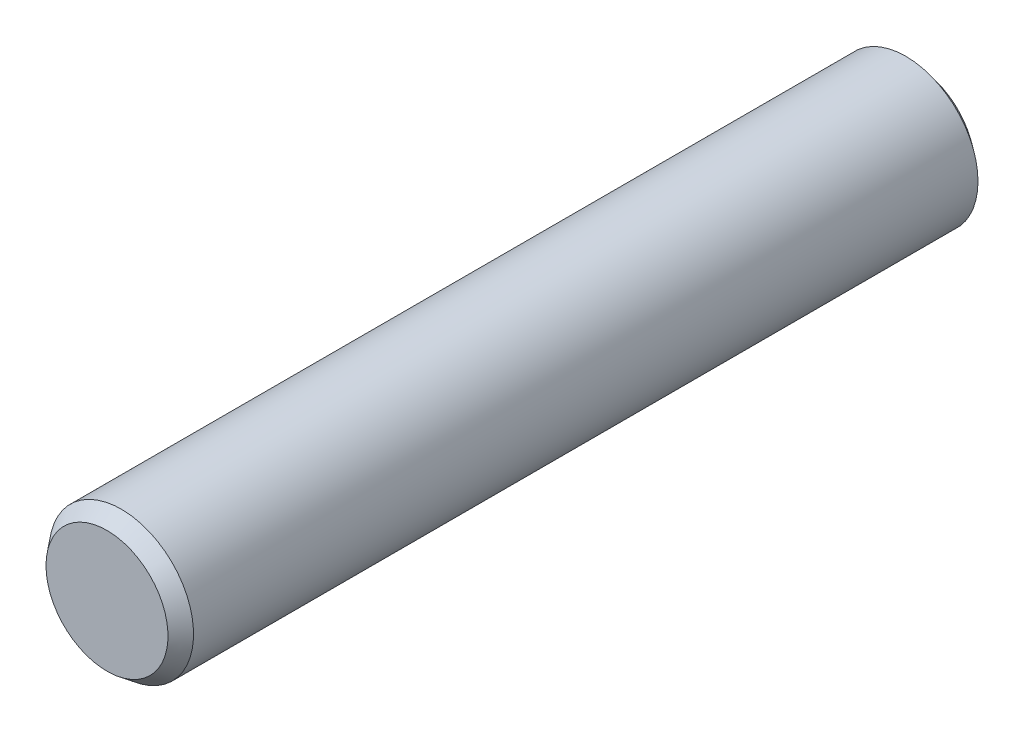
ISO-10303-21;
HEADER;
FILE_DESCRIPTION(('STEP AP214'),'2;1');
FILE_NAME('part.step','',(''),(''),'','','');
FILE_SCHEMA(('AUTOMOTIVE_DESIGN { 1 0 10303 214 1 1 1 1 }'));
ENDSEC;
DATA;
#1=APPLICATION_CONTEXT('core data for automotive mechanical design processes');
#2=APPLICATION_PROTOCOL_DEFINITION('international standard','automotive_design',2000,#1);
#3=PRODUCT_CONTEXT('',#1,'mechanical');
#4=PRODUCT('Part','Part','',(#3));
#5=PRODUCT_RELATED_PRODUCT_CATEGORY('part','',(#4));
#6=PRODUCT_DEFINITION_FORMATION('','',#4);
#7=PRODUCT_DEFINITION_CONTEXT('part definition',#1,'design');
#8=PRODUCT_DEFINITION('design','',#6,#7);
#9=PRODUCT_DEFINITION_SHAPE('','',#8);
#10=(LENGTH_UNIT() NAMED_UNIT(*) SI_UNIT(.MILLI.,.METRE.));
#11=(NAMED_UNIT(*) PLANE_ANGLE_UNIT() SI_UNIT($,.RADIAN.));
#12=(NAMED_UNIT(*) SI_UNIT($,.STERADIAN.) SOLID_ANGLE_UNIT());
#13=UNCERTAINTY_MEASURE_WITH_UNIT(LENGTH_MEASURE(1.E-05),#10,'distance_accuracy_value','');
#14=(GEOMETRIC_REPRESENTATION_CONTEXT(3) GLOBAL_UNCERTAINTY_ASSIGNED_CONTEXT((#13)) GLOBAL_UNIT_ASSIGNED_CONTEXT((#10,
#11,#12)) REPRESENTATION_CONTEXT('',''));
#15=CARTESIAN_POINT('',(0.,0.,0.));
#16=DIRECTION('',(0.,0.,1.));
#17=DIRECTION('',(1.,0.,0.));
#18=AXIS2_PLACEMENT_3D('',#15,#16,#17);
#19=CARTESIAN_POINT('',(0.,0.,44.45));
#20=DIRECTION('',(0.,0.,-1.));
#21=DIRECTION('',(-1.,0.,0.));
#22=AXIS2_PLACEMENT_3D('',#19,#20,#21);
#23=CYLINDRICAL_SURFACE('',#22,3.9624);
#24=CARTESIAN_POINT('',(0.,0.,0.615184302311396));
#25=DIRECTION('',(0.,0.,1.));
#26=DIRECTION('',(1.,0.,0.));
#27=AXIS2_PLACEMENT_3D('',#24,#25,#26);
#28=CIRCLE('',#27,3.9624);
#29=CARTESIAN_POINT('',(3.9624,0.,0.615184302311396));
#30=VERTEX_POINT('',#29);
#31=EDGE_CURVE('E42',#30,#30,#28,.T.);
#32=ORIENTED_EDGE('',*,*,#31,.T.);
#33=EDGE_LOOP('',(#32));
#34=FACE_BOUND('',#33,.T.);
#35=CARTESIAN_POINT('',(0.,0.,43.6626));
#36=DIRECTION('',(0.,0.,1.));
#37=DIRECTION('',(1.,0.,0.));
#38=AXIS2_PLACEMENT_3D('',#35,#36,#37);
#39=CIRCLE('',#38,3.9624);
#40=CARTESIAN_POINT('',(-3.9624,0.,43.6626));
#41=VERTEX_POINT('',#40);
#42=EDGE_CURVE('E46',#41,#41,#39,.F.);
#43=ORIENTED_EDGE('',*,*,#42,.T.);
#44=EDGE_LOOP('',(#43));
#45=FACE_BOUND('',#44,.T.);
#46=ADVANCED_FACE('F31',(#34,#45),#23,.T.);
#47=CARTESIAN_POINT('',(0.,0.,44.45));
#48=DIRECTION('',(0.,0.,1.));
#49=DIRECTION('',(1.,0.,0.));
#50=AXIS2_PLACEMENT_3D('',#47,#48,#49);
#51=PLANE('',#50);
#52=CARTESIAN_POINT('',(0.,0.,44.45));
#53=DIRECTION('',(0.,0.,1.));
#54=DIRECTION('',(1.,0.,0.));
#55=AXIS2_PLACEMENT_3D('',#52,#53,#54);
#56=CIRCLE('',#55,3.3472156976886);
#57=CARTESIAN_POINT('',(-3.3472156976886,0.,44.45));
#58=VERTEX_POINT('',#57);
#59=EDGE_CURVE('E10',#58,#58,#56,.T.);
#60=ORIENTED_EDGE('',*,*,#59,.T.);
#61=EDGE_LOOP('',(#60));
#62=FACE_BOUND('',#61,.T.);
#63=ADVANCED_FACE('F62',(#62),#51,.T.);
#64=CARTESIAN_POINT('',(0.,0.,0.));
#65=DIRECTION('',(0.,0.,1.));
#66=DIRECTION('',(1.,0.,0.));
#67=AXIS2_PLACEMENT_3D('',#64,#65,#66);
#68=PLANE('',#67);
#69=CARTESIAN_POINT('',(0.,0.,0.));
#70=DIRECTION('',(0.,0.,1.));
#71=DIRECTION('',(1.,0.,0.));
#72=AXIS2_PLACEMENT_3D('',#69,#70,#71);
#73=CIRCLE('',#72,3.17499999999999);
#74=CARTESIAN_POINT('',(3.17499999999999,0.,0.));
#75=VERTEX_POINT('',#74);
#76=EDGE_CURVE('E38',#75,#75,#73,.F.);
#77=ORIENTED_EDGE('',*,*,#76,.T.);
#78=EDGE_LOOP('',(#77));
#79=FACE_BOUND('',#78,.T.);
#80=ADVANCED_FACE('F59',(#79),#68,.F.);
#81=CARTESIAN_POINT('',(0.,0.,0.615184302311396));
#82=DIRECTION('',(0.,0.,1.));
#83=DIRECTION('',(1.,0.,0.));
#84=AXIS2_PLACEMENT_3D('',#81,#82,#83);
#85=CONICAL_SURFACE('',#84,3.9624,0.907571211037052);
#86=ORIENTED_EDGE('',*,*,#76,.F.);
#87=EDGE_LOOP('',(#86));
#88=FACE_BOUND('',#87,.T.);
#89=ORIENTED_EDGE('',*,*,#31,.F.);
#90=EDGE_LOOP('',(#89));
#91=FACE_BOUND('',#90,.T.);
#92=ADVANCED_FACE('F55',(#88,#91),#85,.T.);
#93=CARTESIAN_POINT('',(0.,0.,44.45));
#94=DIRECTION('',(0.,0.,-1.));
#95=DIRECTION('',(-1.,0.,0.));
#96=AXIS2_PLACEMENT_3D('',#93,#94,#95);
#97=CONICAL_SURFACE('',#96,3.3472156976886,0.663225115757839);
#98=CARTESIAN_POINT('',(-3.9624,0.,43.6626));
#99=CARTESIAN_POINT('',(-3.95599183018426,0.,43.6708020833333));
#100=CARTESIAN_POINT('',(-3.94958366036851,0.,43.6790041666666));
#101=CARTESIAN_POINT('',(-3.93676732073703,0.,43.6954083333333));
#102=CARTESIAN_POINT('',(-3.93035915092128,0.,43.7036104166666));
#103=CARTESIAN_POINT('',(-3.9175428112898,0.,43.7200145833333));
#104=CARTESIAN_POINT('',(-3.91113464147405,0.,43.7282166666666));
#105=CARTESIAN_POINT('',(-3.89831830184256,0.,43.7446208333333));
#106=CARTESIAN_POINT('',(-3.89191013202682,0.,43.7528229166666));
#107=CARTESIAN_POINT('',(-3.87909379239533,0.,43.7692270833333));
#108=CARTESIAN_POINT('',(-3.87268562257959,0.,43.7774291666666));
#109=CARTESIAN_POINT('',(-3.8598692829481,0.,43.7938333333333));
#110=CARTESIAN_POINT('',(-3.85346111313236,0.,43.8020354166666));
#111=CARTESIAN_POINT('',(-3.84064477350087,0.,43.8184395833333));
#112=CARTESIAN_POINT('',(-3.83423660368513,0.,43.8266416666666));
#113=CARTESIAN_POINT('',(-3.82142026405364,0.,43.8430458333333));
#114=CARTESIAN_POINT('',(-3.8150120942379,0.,43.8512479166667));
#115=CARTESIAN_POINT('',(-3.80219575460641,0.,43.8676520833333));
#116=CARTESIAN_POINT('',(-3.79578758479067,0.,43.8758541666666));
#117=CARTESIAN_POINT('',(-3.78297124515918,0.,43.8922583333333));
#118=CARTESIAN_POINT('',(-3.77656307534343,0.,43.9004604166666));
#119=CARTESIAN_POINT('',(-3.76374673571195,0.,43.9168645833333));
#120=CARTESIAN_POINT('',(-3.7573385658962,0.,43.9250666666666));
#121=CARTESIAN_POINT('',(-3.74452222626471,0.,43.9414708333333));
#122=CARTESIAN_POINT('',(-3.73811405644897,0.,43.9496729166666));
#123=CARTESIAN_POINT('',(-3.72529771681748,0.,43.9660770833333));
#124=CARTESIAN_POINT('',(-3.71888954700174,0.,43.9742791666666));
#125=CARTESIAN_POINT('',(-3.70607320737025,0.,43.9906833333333));
#126=CARTESIAN_POINT('',(-3.69966503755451,0.,43.9988854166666));
#127=CARTESIAN_POINT('',(-3.68684869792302,0.,44.0152895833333));
#128=CARTESIAN_POINT('',(-3.68044052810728,0.,44.0234916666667));
#129=CARTESIAN_POINT('',(-3.66762418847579,0.,44.0398958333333));
#130=CARTESIAN_POINT('',(-3.66121601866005,0.,44.0480979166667));
#131=CARTESIAN_POINT('',(-3.64839967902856,0.,44.0645020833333));
#132=CARTESIAN_POINT('',(-3.64199150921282,0.,44.0727041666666));
#133=CARTESIAN_POINT('',(-3.62917516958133,0.,44.0891083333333));
#134=CARTESIAN_POINT('',(-3.62276699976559,0.,44.0973104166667));
#135=CARTESIAN_POINT('',(-3.6099506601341,0.,44.1137145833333));
#136=CARTESIAN_POINT('',(-3.60354249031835,0.,44.1219166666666));
#137=CARTESIAN_POINT('',(-3.59072615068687,0.,44.1383208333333));
#138=CARTESIAN_POINT('',(-3.58431798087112,0.,44.1465229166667));
#139=CARTESIAN_POINT('',(-3.57150164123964,0.,44.1629270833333));
#140=CARTESIAN_POINT('',(-3.56509347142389,0.,44.1711291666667));
#141=CARTESIAN_POINT('',(-3.5522771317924,0.,44.1875333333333));
#142=CARTESIAN_POINT('',(-3.54586896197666,0.,44.1957354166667));
#143=CARTESIAN_POINT('',(-3.53305262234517,0.,44.2121395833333));
#144=CARTESIAN_POINT('',(-3.52664445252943,0.,44.2203416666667));
#145=CARTESIAN_POINT('',(-3.51382811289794,0.,44.2367458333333));
#146=CARTESIAN_POINT('',(-3.5074199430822,0.,44.2449479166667));
#147=CARTESIAN_POINT('',(-3.49460360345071,0.,44.2613520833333));
#148=CARTESIAN_POINT('',(-3.48819543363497,0.,44.2695541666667));
#149=CARTESIAN_POINT('',(-3.47537909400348,0.,44.2859583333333));
#150=CARTESIAN_POINT('',(-3.46897092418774,0.,44.2941604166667));
#151=CARTESIAN_POINT('',(-3.45615458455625,0.,44.3105645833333));
#152=CARTESIAN_POINT('',(-3.4497464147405,0.,44.3187666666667));
#153=CARTESIAN_POINT('',(-3.43693007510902,0.,44.3351708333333));
#154=CARTESIAN_POINT('',(-3.43052190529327,0.,44.3433729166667));
#155=CARTESIAN_POINT('',(-3.41770556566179,0.,44.3597770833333));
#156=CARTESIAN_POINT('',(-3.41129739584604,0.,44.3679791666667));
#157=CARTESIAN_POINT('',(-3.39848105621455,0.,44.3843833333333));
#158=CARTESIAN_POINT('',(-3.39207288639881,0.,44.3925854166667));
#159=CARTESIAN_POINT('',(-3.37925654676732,0.,44.4089895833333));
#160=CARTESIAN_POINT('',(-3.37284837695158,0.,44.4171916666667));
#161=CARTESIAN_POINT('',(-3.36003203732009,0.,44.4335958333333));
#162=CARTESIAN_POINT('',(-3.35362386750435,0.,44.4417979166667));
#163=CARTESIAN_POINT('',(-3.3472156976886,0.,44.45));
#164=B_SPLINE_CURVE_WITH_KNOTS('',3,(#98,#99,#100,#101,#102,#103,#104,#105,#106,#107,#108,#109,
#110,#111,#112,#113,#114,#115,#116,#117,#118,#119,#120,#121,#122,#123,#124,#125,#126,#127,#128,
#129,#130,#131,#132,#133,#134,#135,#136,#137,#138,#139,#140,#141,#142,#143,#144,#145,#146,#147,
#148,#149,#150,#151,#152,#153,#154,#155,#156,#157,#158,#159,#160,#161,#162,#163),.UNSPECIFIED.,
.F.,.F.,(4,2,2,2,2,2,2,2,2,2,2,2,2,2,2,2,2,2,2,2,2,2,2,2,2,2,2,2,2,2,2,2,4),(0.,
0.0312257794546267,0.062451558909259,0.093677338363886,0.124903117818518,0.156128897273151,
0.187354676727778,0.21858045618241,0.249806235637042,0.281032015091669,0.312257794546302,
0.343483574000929,0.374709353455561,0.405935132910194,0.43716091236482,0.468386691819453,
0.499612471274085,0.530838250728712,0.562064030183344,0.593289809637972,0.624515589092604,
0.655741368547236,0.686967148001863,0.718192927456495,0.749418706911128,0.780644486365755,
0.811870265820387,0.843096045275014,0.874321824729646,0.905547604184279,0.936773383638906,
0.967999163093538,0.999224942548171),.UNSPECIFIED.);
#165=EDGE_CURVE('BSEAM33',#41,#58,#164,.T.);
#166=ORIENTED_EDGE('',*,*,#42,.F.);
#167=ORIENTED_EDGE('',*,*,#59,.F.);
#168=ORIENTED_EDGE('',*,*,#165,.T.);
#169=ORIENTED_EDGE('',*,*,#165,.F.);
#170=EDGE_LOOP('',(#166,#168,#167,#169));
#171=FACE_BOUND('',#170,.T.);
#172=ADVANCED_FACE('F33',(#171),#97,.T.);
#173=CLOSED_SHELL('',(#46,#63,#80,#92,#172));
#174=MANIFOLD_SOLID_BREP('B2',#173);
#175=ADVANCED_BREP_SHAPE_REPRESENTATION('',(#18,#174),#14);
#176=SHAPE_DEFINITION_REPRESENTATION(#9,#175);
ENDSEC;
END-ISO-10303-21;
